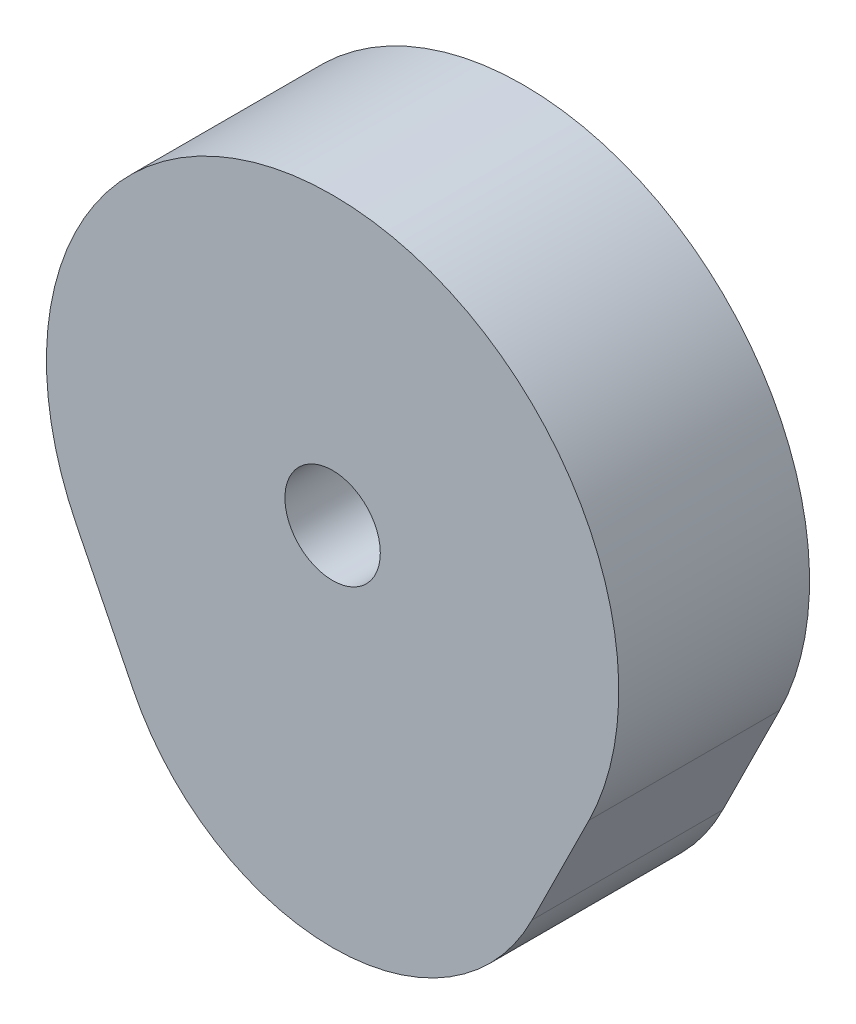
from build123d import *

# Parameters (mm, degrees)
BOSS_EXTRUDE1_DEPTH      = 3
BOSS_EXTRUDE1_DEPTH_BACK = 3
SKETCH1_R                = 1.5


with BuildPart() as part:
    # Sketch1 → Boss-Extrude1 (new, two sides: drawn at the far end of the back side and taken through both)
    with BuildSketch(Plane.XY.offset(-BOSS_EXTRUDE1_DEPTH_BACK)):
        with BuildLine():
            Line((-8.062257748, -4), (-6.270644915, -7.611111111))
            ThreePointArc((-6.270644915, -7.611111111), (0, -11.5), (6.270644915, -7.611111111))
            Line((6.270644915, -7.611111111), (8.062257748, -4))
            ThreePointArc((8.062257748, -4), (0, 9), (-8.062257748, -4))
        make_face()
        Circle(SKETCH1_R, mode=Mode.SUBTRACT)
    extrude(amount=BOSS_EXTRUDE1_DEPTH + BOSS_EXTRUDE1_DEPTH_BACK)


solid = part.part
